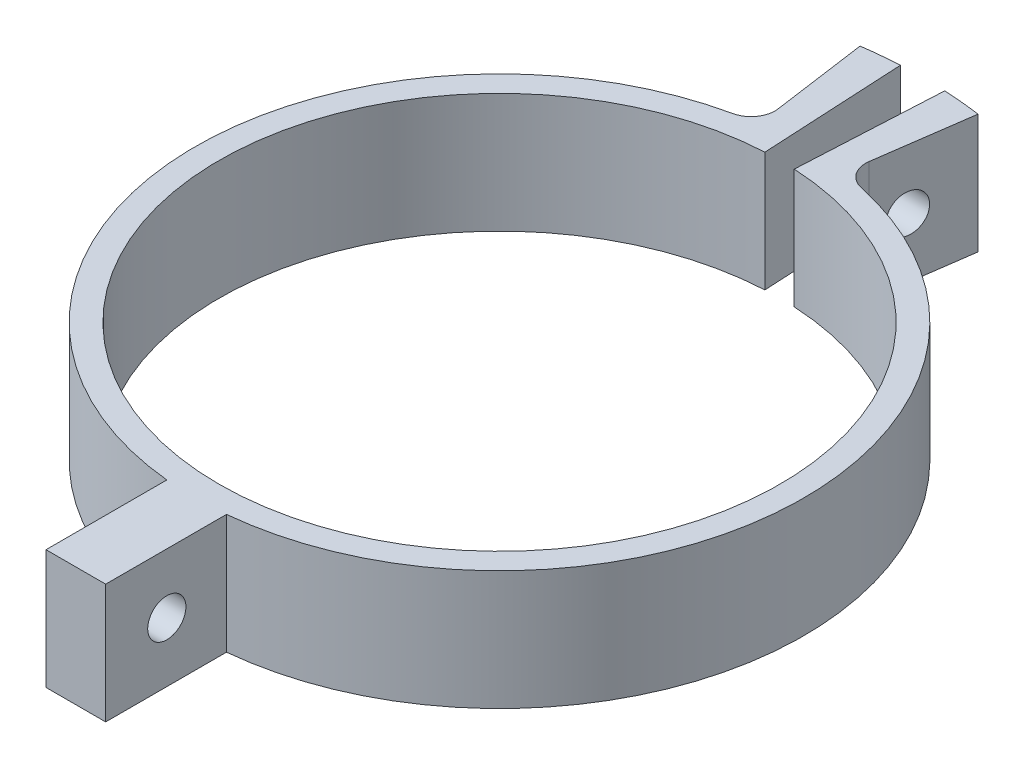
ISO-10303-21;
HEADER;
FILE_DESCRIPTION(('STEP AP214'),'2;1');
FILE_NAME('part.step','',(''),(''),'','','');
FILE_SCHEMA(('AUTOMOTIVE_DESIGN { 1 0 10303 214 1 1 1 1 }'));
ENDSEC;
DATA;
#1=APPLICATION_CONTEXT('core data for automotive mechanical design processes');
#2=APPLICATION_PROTOCOL_DEFINITION('international standard','automotive_design',2000,#1);
#3=PRODUCT_CONTEXT('',#1,'mechanical');
#4=PRODUCT('Part','Part','',(#3));
#5=PRODUCT_RELATED_PRODUCT_CATEGORY('part','',(#4));
#6=PRODUCT_DEFINITION_FORMATION('','',#4);
#7=PRODUCT_DEFINITION_CONTEXT('part definition',#1,'design');
#8=PRODUCT_DEFINITION('design','',#6,#7);
#9=PRODUCT_DEFINITION_SHAPE('','',#8);
#10=(LENGTH_UNIT() NAMED_UNIT(*) SI_UNIT(.MILLI.,.METRE.));
#11=(NAMED_UNIT(*) PLANE_ANGLE_UNIT() SI_UNIT($,.RADIAN.));
#12=(NAMED_UNIT(*) SI_UNIT($,.STERADIAN.) SOLID_ANGLE_UNIT());
#13=UNCERTAINTY_MEASURE_WITH_UNIT(LENGTH_MEASURE(1.E-05),#10,'distance_accuracy_value','');
#14=(GEOMETRIC_REPRESENTATION_CONTEXT(3) GLOBAL_UNCERTAINTY_ASSIGNED_CONTEXT((#13)) GLOBAL_UNIT_ASSIGNED_CONTEXT((#10,
#11,#12)) REPRESENTATION_CONTEXT('',''));
#15=CARTESIAN_POINT('',(0.,0.,0.));
#16=DIRECTION('',(0.,0.,1.));
#17=DIRECTION('',(1.,0.,0.));
#18=AXIS2_PLACEMENT_3D('',#15,#16,#17);
#19=CARTESIAN_POINT('',(0.,12.7,0.));
#20=DIRECTION('',(0.,-1.,0.));
#21=DIRECTION('',(0.,0.,-1.));
#22=AXIS2_PLACEMENT_3D('',#19,#20,#21);
#23=CYLINDRICAL_SURFACE('',#22,32.385);
#24=CARTESIAN_POINT('',(0.,12.7,0.));
#25=DIRECTION('',(0.,1.,0.));
#26=DIRECTION('',(0.,0.,1.));
#27=AXIS2_PLACEMENT_3D('',#24,#25,#26);
#28=CIRCLE('',#27,32.385);
#29=CARTESIAN_POINT('',(-6.82753678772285,12.7,-31.6571155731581));
#30=VERTEX_POINT('',#29);
#31=CARTESIAN_POINT('',(-3.175,12.7,32.2289869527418));
#32=VERTEX_POINT('',#31);
#33=EDGE_CURVE('E226',#30,#32,#28,.T.);
#34=ORIENTED_EDGE('',*,*,#33,.F.);
#35=DIRECTION('',(0.,-1.,0.));
#36=VECTOR('',#35,1.);
#37=CARTESIAN_POINT('',(-6.82753678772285,12.7,-31.6571155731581));
#38=LINE('',#37,#36);
#39=CARTESIAN_POINT('',(-6.82753678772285,0.,-31.6571155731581));
#40=VERTEX_POINT('',#39);
#41=EDGE_CURVE('E246',#30,#40,#38,.T.);
#42=ORIENTED_EDGE('',*,*,#41,.T.);
#43=CARTESIAN_POINT('',(0.,0.,0.));
#44=DIRECTION('',(0.,1.,0.));
#45=DIRECTION('',(0.,0.,1.));
#46=AXIS2_PLACEMENT_3D('',#43,#44,#45);
#47=CIRCLE('',#46,32.385);
#48=CARTESIAN_POINT('',(-3.175,0.,32.2289869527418));
#49=VERTEX_POINT('',#48);
#50=EDGE_CURVE('E229',#40,#49,#47,.T.);
#51=ORIENTED_EDGE('',*,*,#50,.T.);
#52=DIRECTION('',(0.,-1.,0.));
#53=VECTOR('',#52,1.);
#54=CARTESIAN_POINT('',(-3.175,12.7,32.2289869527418));
#55=LINE('',#54,#53);
#56=EDGE_CURVE('E234',#32,#49,#55,.T.);
#57=ORIENTED_EDGE('',*,*,#56,.F.);
#58=EDGE_LOOP('',(#34,#42,#51,#57));
#59=FACE_BOUND('',#58,.T.);
#60=ADVANCED_FACE('F32',(#59),#23,.T.);
#61=CARTESIAN_POINT('',(0.,12.7,0.));
#62=DIRECTION('',(0.,1.,0.));
#63=DIRECTION('',(0.,0.,1.));
#64=AXIS2_PLACEMENT_3D('',#61,#62,#63);
#65=CYLINDRICAL_SURFACE('',#64,45.085);
#66=DIRECTION('',(0.,1.,0.));
#67=VECTOR('',#66,1.);
#68=CARTESIAN_POINT('',(2.35956658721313,0.,-45.02321257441));
#69=LINE('',#68,#67);
#70=CARTESIAN_POINT('',(2.35956658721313,0.,-45.02321257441));
#71=VERTEX_POINT('',#70);
#72=CARTESIAN_POINT('',(2.35956658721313,12.7,-45.02321257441));
#73=VERTEX_POINT('',#72);
#74=EDGE_CURVE('E182',#71,#73,#69,.T.);
#75=ORIENTED_EDGE('',*,*,#74,.T.);
#76=CARTESIAN_POINT('',(0.,12.7,0.));
#77=DIRECTION('',(0.,1.,0.));
#78=DIRECTION('',(0.,0.,1.));
#79=AXIS2_PLACEMENT_3D('',#76,#77,#78);
#80=CIRCLE('',#79,45.085);
#81=CARTESIAN_POINT('',(6.27461925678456,12.7,-44.6462358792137));
#82=VERTEX_POINT('',#81);
#83=EDGE_CURVE('E214',#82,#73,#80,.T.);
#84=ORIENTED_EDGE('',*,*,#83,.F.);
#85=DIRECTION('',(0.,1.,0.));
#86=VECTOR('',#85,1.);
#87=CARTESIAN_POINT('',(6.27461925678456,0.,-44.6462358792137));
#88=LINE('',#87,#86);
#89=CARTESIAN_POINT('',(6.27461925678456,0.,-44.6462358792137));
#90=VERTEX_POINT('',#89);
#91=EDGE_CURVE('E207',#90,#82,#88,.T.);
#92=ORIENTED_EDGE('',*,*,#91,.F.);
#93=CARTESIAN_POINT('',(0.,0.,0.));
#94=DIRECTION('',(0.,1.,0.));
#95=DIRECTION('',(0.,0.,1.));
#96=AXIS2_PLACEMENT_3D('',#93,#94,#95);
#97=CIRCLE('',#96,45.085);
#98=EDGE_CURVE('E218',#90,#71,#97,.T.);
#99=ORIENTED_EDGE('',*,*,#98,.T.);
#100=EDGE_LOOP('',(#75,#84,#92,#99));
#101=FACE_BOUND('',#100,.T.);
#102=ADVANCED_FACE('F275',(#101),#65,.T.);
#103=CARTESIAN_POINT('',(0.,12.7,0.));
#104=DIRECTION('',(0.,1.,0.));
#105=DIRECTION('',(0.,0.,1.));
#106=AXIS2_PLACEMENT_3D('',#103,#104,#105);
#107=PLANE('',#106);
#108=DIRECTION('',(-0.052335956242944,0.,0.998629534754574));
#109=VECTOR('',#108,1.);
#110=CARTESIAN_POINT('',(0.,12.7,0.));
#111=LINE('',#110,#109);
#112=CARTESIAN_POINT('',(1.56196661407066,12.7,-29.8040984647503));
#113=VERTEX_POINT('',#112);
#114=EDGE_CURVE('E185',#73,#113,#111,.T.);
#115=ORIENTED_EDGE('',*,*,#114,.T.);
#116=CARTESIAN_POINT('',(0.,12.7,0.));
#117=DIRECTION('',(0.,1.,0.));
#118=DIRECTION('',(0.,0.,1.));
#119=AXIS2_PLACEMENT_3D('',#116,#117,#118);
#120=CIRCLE('',#119,29.845);
#121=CARTESIAN_POINT('',(-1.56196661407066,12.7,-29.8040984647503));
#122=VERTEX_POINT('',#121);
#123=EDGE_CURVE('E222',#122,#113,#120,.T.);
#124=ORIENTED_EDGE('',*,*,#123,.F.);
#125=DIRECTION('',(0.052335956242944,0.,0.998629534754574));
#126=VECTOR('',#125,1.);
#127=CARTESIAN_POINT('',(0.,12.7,0.));
#128=LINE('',#127,#126);
#129=CARTESIAN_POINT('',(-2.35956658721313,12.7,-45.02321257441));
#130=VERTEX_POINT('',#129);
#131=EDGE_CURVE('E191',#130,#122,#128,.T.);
#132=ORIENTED_EDGE('',*,*,#131,.F.);
#133=CARTESIAN_POINT('',(-6.27461925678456,12.7,-44.6462358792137));
#134=VERTEX_POINT('',#133);
#135=EDGE_CURVE('E213',#130,#134,#80,.T.);
#136=ORIENTED_EDGE('',*,*,#135,.T.);
#137=DIRECTION('',(0.139173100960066,0.,0.99026806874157));
#138=VECTOR('',#137,1.);
#139=CARTESIAN_POINT('',(-4.50712087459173,12.7,-32.0698314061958));
#140=LINE('',#139,#138);
#141=CARTESIAN_POINT('',(-4.84774897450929,12.7,-34.4935262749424));
#142=VERTEX_POINT('',#141);
#143=EDGE_CURVE('E203',#134,#142,#140,.T.);
#144=ORIENTED_EDGE('',*,*,#143,.T.);
#145=CARTESIAN_POINT('',(-7.36302986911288,12.7,-34.1400265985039));
#146=DIRECTION('',(0.,1.,0.));
#147=DIRECTION('',(0.,0.,1.));
#148=AXIS2_PLACEMENT_3D('',#145,#146,#147);
#149=CIRCLE('',#148,2.54);
#150=EDGE_CURVE('E11',#142,#30,#149,.F.);
#151=ORIENTED_EDGE('',*,*,#150,.T.);
#152=ORIENTED_EDGE('',*,*,#33,.T.);
#153=DIRECTION('',(0.,0.,1.));
#154=VECTOR('',#153,1.);
#155=CARTESIAN_POINT('',(-3.175,12.7,29.845));
#156=LINE('',#155,#154);
#157=CARTESIAN_POINT('',(-3.175,12.7,45.085));
#158=VERTEX_POINT('',#157);
#159=EDGE_CURVE('E150',#32,#158,#156,.T.);
#160=ORIENTED_EDGE('',*,*,#159,.T.);
#161=DIRECTION('',(1.,0.,0.));
#162=VECTOR('',#161,1.);
#163=CARTESIAN_POINT('',(-3.175,12.7,45.085));
#164=LINE('',#163,#162);
#165=CARTESIAN_POINT('',(3.175,12.7,45.085));
#166=VERTEX_POINT('',#165);
#167=EDGE_CURVE('E146',#158,#166,#164,.T.);
#168=ORIENTED_EDGE('',*,*,#167,.T.);
#169=DIRECTION('',(0.,0.,1.));
#170=VECTOR('',#169,1.);
#171=CARTESIAN_POINT('',(3.175,12.7,29.845));
#172=LINE('',#171,#170);
#173=CARTESIAN_POINT('',(3.175,12.7,32.2289869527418));
#174=VERTEX_POINT('',#173);
#175=EDGE_CURVE('E132',#174,#166,#172,.T.);
#176=ORIENTED_EDGE('',*,*,#175,.F.);
#177=CARTESIAN_POINT('',(6.82753678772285,12.7,-31.6571155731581));
#178=VERTEX_POINT('',#177);
#179=EDGE_CURVE('E228',#174,#178,#28,.T.);
#180=ORIENTED_EDGE('',*,*,#179,.T.);
#181=CARTESIAN_POINT('',(7.36302986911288,12.7,-34.1400265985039));
#182=DIRECTION('',(0.,1.,0.));
#183=DIRECTION('',(0.,0.,1.));
#184=AXIS2_PLACEMENT_3D('',#181,#182,#183);
#185=CIRCLE('',#184,2.54);
#186=CARTESIAN_POINT('',(4.84774897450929,12.7,-34.4935262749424));
#187=VERTEX_POINT('',#186);
#188=EDGE_CURVE('E244',#178,#187,#185,.F.);
#189=ORIENTED_EDGE('',*,*,#188,.T.);
#190=DIRECTION('',(-0.139173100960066,0.,0.99026806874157));
#191=VECTOR('',#190,1.);
#192=CARTESIAN_POINT('',(4.50712087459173,12.7,-32.0698314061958));
#193=LINE('',#192,#191);
#194=EDGE_CURVE('E210',#82,#187,#193,.T.);
#195=ORIENTED_EDGE('',*,*,#194,.F.);
#196=ORIENTED_EDGE('',*,*,#83,.T.);
#197=EDGE_LOOP('',(#115,#124,#132,#136,#144,#151,#152,#160,#168,#176,#180,#189,#195,#196));
#198=FACE_BOUND('',#197,.T.);
#199=ADVANCED_FACE('F148',(#198),#107,.T.);
#200=CARTESIAN_POINT('',(0.,0.,0.));
#201=DIRECTION('',(0.,1.,0.));
#202=DIRECTION('',(0.,0.,1.));
#203=AXIS2_PLACEMENT_3D('',#200,#201,#202);
#204=PLANE('',#203);
#205=CARTESIAN_POINT('',(0.,0.,0.));
#206=DIRECTION('',(0.,1.,0.));
#207=DIRECTION('',(0.,0.,1.));
#208=AXIS2_PLACEMENT_3D('',#205,#206,#207);
#209=CIRCLE('',#208,29.845);
#210=CARTESIAN_POINT('',(-1.56196661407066,0.,-29.8040984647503));
#211=VERTEX_POINT('',#210);
#212=CARTESIAN_POINT('',(1.56196661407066,0.,-29.8040984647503));
#213=VERTEX_POINT('',#212);
#214=EDGE_CURVE('E221',#211,#213,#209,.T.);
#215=ORIENTED_EDGE('',*,*,#214,.T.);
#216=DIRECTION('',(0.052335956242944,0.,-0.998629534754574));
#217=VECTOR('',#216,1.);
#218=CARTESIAN_POINT('',(0.,0.,0.));
#219=LINE('',#218,#217);
#220=EDGE_CURVE('E179',#213,#71,#219,.T.);
#221=ORIENTED_EDGE('',*,*,#220,.T.);
#222=ORIENTED_EDGE('',*,*,#98,.F.);
#223=DIRECTION('',(0.139173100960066,0.,-0.99026806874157));
#224=VECTOR('',#223,1.);
#225=CARTESIAN_POINT('',(4.50712087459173,0.,-32.0698314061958));
#226=LINE('',#225,#224);
#227=CARTESIAN_POINT('',(4.84774897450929,0.,-34.4935262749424));
#228=VERTEX_POINT('',#227);
#229=EDGE_CURVE('E205',#228,#90,#226,.T.);
#230=ORIENTED_EDGE('',*,*,#229,.F.);
#231=CARTESIAN_POINT('',(7.36302986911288,0.,-34.1400265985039));
#232=DIRECTION('',(0.,1.,0.));
#233=DIRECTION('',(0.,0.,1.));
#234=AXIS2_PLACEMENT_3D('',#231,#232,#233);
#235=CIRCLE('',#234,2.54);
#236=CARTESIAN_POINT('',(6.82753678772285,0.,-31.6571155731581));
#237=VERTEX_POINT('',#236);
#238=EDGE_CURVE('E242',#228,#237,#235,.T.);
#239=ORIENTED_EDGE('',*,*,#238,.T.);
#240=CARTESIAN_POINT('',(3.175,0.,32.2289869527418));
#241=VERTEX_POINT('',#240);
#242=EDGE_CURVE('E224',#241,#237,#47,.T.);
#243=ORIENTED_EDGE('',*,*,#242,.F.);
#244=DIRECTION('',(0.,0.,-1.));
#245=VECTOR('',#244,1.);
#246=CARTESIAN_POINT('',(3.175,0.,29.845));
#247=LINE('',#246,#245);
#248=CARTESIAN_POINT('',(3.175,0.,45.085));
#249=VERTEX_POINT('',#248);
#250=EDGE_CURVE('E158',#249,#241,#247,.T.);
#251=ORIENTED_EDGE('',*,*,#250,.F.);
#252=DIRECTION('',(1.,0.,0.));
#253=VECTOR('',#252,1.);
#254=CARTESIAN_POINT('',(-3.175,0.,45.085));
#255=LINE('',#254,#253);
#256=CARTESIAN_POINT('',(-3.175,0.,45.085));
#257=VERTEX_POINT('',#256);
#258=EDGE_CURVE('E154',#257,#249,#255,.T.);
#259=ORIENTED_EDGE('',*,*,#258,.F.);
#260=DIRECTION('',(0.,0.,-1.));
#261=VECTOR('',#260,1.);
#262=CARTESIAN_POINT('',(-3.175,0.,29.845));
#263=LINE('',#262,#261);
#264=EDGE_CURVE('E155',#257,#49,#263,.T.);
#265=ORIENTED_EDGE('',*,*,#264,.T.);
#266=ORIENTED_EDGE('',*,*,#50,.F.);
#267=CARTESIAN_POINT('',(-7.36302986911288,0.,-34.1400265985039));
#268=DIRECTION('',(0.,1.,0.));
#269=DIRECTION('',(0.,0.,1.));
#270=AXIS2_PLACEMENT_3D('',#267,#268,#269);
#271=CIRCLE('',#270,2.54);
#272=CARTESIAN_POINT('',(-4.84774897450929,0.,-34.4935262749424));
#273=VERTEX_POINT('',#272);
#274=EDGE_CURVE('E40',#40,#273,#271,.T.);
#275=ORIENTED_EDGE('',*,*,#274,.T.);
#276=DIRECTION('',(-0.139173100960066,0.,-0.99026806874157));
#277=VECTOR('',#276,1.);
#278=CARTESIAN_POINT('',(-4.50712087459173,0.,-32.0698314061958));
#279=LINE('',#278,#277);
#280=CARTESIAN_POINT('',(-6.27461925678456,0.,-44.6462358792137));
#281=VERTEX_POINT('',#280);
#282=EDGE_CURVE('E198',#273,#281,#279,.T.);
#283=ORIENTED_EDGE('',*,*,#282,.T.);
#284=CARTESIAN_POINT('',(-2.35956658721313,0.,-45.02321257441));
#285=VERTEX_POINT('',#284);
#286=EDGE_CURVE('E217',#285,#281,#97,.T.);
#287=ORIENTED_EDGE('',*,*,#286,.F.);
#288=DIRECTION('',(-0.052335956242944,0.,-0.998629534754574));
#289=VECTOR('',#288,1.);
#290=CARTESIAN_POINT('',(0.,0.,0.));
#291=LINE('',#290,#289);
#292=EDGE_CURVE('E187',#211,#285,#291,.T.);
#293=ORIENTED_EDGE('',*,*,#292,.F.);
#294=EDGE_LOOP('',(#215,#221,#222,#230,#239,#243,#251,#259,#265,#266,#275,#283,#287,#293));
#295=FACE_BOUND('',#294,.T.);
#296=ADVANCED_FACE('F255',(#295),#204,.F.);
#297=ORIENTED_EDGE('',*,*,#242,.T.);
#298=DIRECTION('',(0.,-1.,0.));
#299=VECTOR('',#298,1.);
#300=CARTESIAN_POINT('',(6.82753678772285,12.7,-31.6571155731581));
#301=LINE('',#300,#299);
#302=EDGE_CURVE('E240',#237,#178,#301,.F.);
#303=ORIENTED_EDGE('',*,*,#302,.T.);
#304=ORIENTED_EDGE('',*,*,#179,.F.);
#305=DIRECTION('',(0.,-1.,0.));
#306=VECTOR('',#305,1.);
#307=CARTESIAN_POINT('',(3.175,12.7,32.2289869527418));
#308=LINE('',#307,#306);
#309=EDGE_CURVE('E139',#174,#241,#308,.T.);
#310=ORIENTED_EDGE('',*,*,#309,.T.);
#311=EDGE_LOOP('',(#297,#303,#304,#310));
#312=FACE_BOUND('',#311,.T.);
#313=ADVANCED_FACE('F277',(#312),#23,.T.);
#314=CARTESIAN_POINT('',(0.,12.7,0.));
#315=DIRECTION('',(0.,-1.,0.));
#316=DIRECTION('',(0.,0.,-1.));
#317=AXIS2_PLACEMENT_3D('',#314,#315,#316);
#318=CYLINDRICAL_SURFACE('',#317,29.845);
#319=DIRECTION('',(0.,-1.,0.));
#320=VECTOR('',#319,1.);
#321=CARTESIAN_POINT('',(1.56196661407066,12.7,-29.8040984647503));
#322=LINE('',#321,#320);
#323=EDGE_CURVE('E193',#113,#213,#322,.T.);
#324=ORIENTED_EDGE('',*,*,#323,.T.);
#325=ORIENTED_EDGE('',*,*,#214,.F.);
#326=DIRECTION('',(0.,-1.,0.));
#327=VECTOR('',#326,1.);
#328=CARTESIAN_POINT('',(-1.56196661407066,12.7,-29.8040984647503));
#329=LINE('',#328,#327);
#330=EDGE_CURVE('E196',#122,#211,#329,.T.);
#331=ORIENTED_EDGE('',*,*,#330,.F.);
#332=ORIENTED_EDGE('',*,*,#123,.T.);
#333=EDGE_LOOP('',(#324,#325,#331,#332));
#334=FACE_BOUND('',#333,.T.);
#335=ADVANCED_FACE('F286',(#334),#318,.F.);
#336=ORIENTED_EDGE('',*,*,#135,.F.);
#337=DIRECTION('',(0.,1.,0.));
#338=VECTOR('',#337,1.);
#339=CARTESIAN_POINT('',(-2.35956658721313,0.,-45.02321257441));
#340=LINE('',#339,#338);
#341=EDGE_CURVE('E189',#285,#130,#340,.T.);
#342=ORIENTED_EDGE('',*,*,#341,.F.);
#343=ORIENTED_EDGE('',*,*,#286,.T.);
#344=DIRECTION('',(0.,1.,0.));
#345=VECTOR('',#344,1.);
#346=CARTESIAN_POINT('',(-6.27461925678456,0.,-44.6462358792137));
#347=LINE('',#346,#345);
#348=EDGE_CURVE('E200',#281,#134,#347,.T.);
#349=ORIENTED_EDGE('',*,*,#348,.T.);
#350=EDGE_LOOP('',(#336,#342,#343,#349));
#351=FACE_BOUND('',#350,.T.);
#352=ADVANCED_FACE('F283',(#351),#65,.T.);
#353=CARTESIAN_POINT('',(0.,0.,0.));
#354=DIRECTION('',(0.99026806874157,0.,0.139173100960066));
#355=DIRECTION('',(0.139173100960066,0.,-0.99026806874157));
#356=AXIS2_PLACEMENT_3D('',#353,#354,#355);
#357=PLANE('',#356);
#358=CARTESIAN_POINT('',(5.35460580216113,6.35,-38.1));
#359=DIRECTION('',(0.99026806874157,0.,0.139173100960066));
#360=DIRECTION('',(-0.139173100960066,0.,0.99026806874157));
#361=AXIS2_PLACEMENT_3D('',#358,#359,#360);
#362=ELLIPSE('',#361,2.05196962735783,2.032);
#363=CARTESIAN_POINT('',(5.06902682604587,6.35,-36.068));
#364=VERTEX_POINT('',#363);
#365=EDGE_CURVE('E176',#364,#364,#362,.F.);
#366=ORIENTED_EDGE('',*,*,#365,.T.);
#367=EDGE_LOOP('',(#366));
#368=FACE_BOUND('',#367,.T.);
#369=ORIENTED_EDGE('',*,*,#194,.T.);
#370=DIRECTION('',(0.,-1.,0.));
#371=VECTOR('',#370,1.);
#372=CARTESIAN_POINT('',(4.84774897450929,0.,-34.4935262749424));
#373=LINE('',#372,#371);
#374=EDGE_CURVE('E237',#187,#228,#373,.T.);
#375=ORIENTED_EDGE('',*,*,#374,.T.);
#376=ORIENTED_EDGE('',*,*,#229,.T.);
#377=ORIENTED_EDGE('',*,*,#91,.T.);
#378=EDGE_LOOP('',(#369,#375,#376,#377));
#379=FACE_BOUND('',#378,.T.);
#380=ADVANCED_FACE('F303',(#368,#379),#357,.T.);
#381=CARTESIAN_POINT('',(0.,0.,0.));
#382=DIRECTION('',(0.99026806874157,0.,-0.139173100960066));
#383=DIRECTION('',(-0.139173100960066,0.,-0.99026806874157));
#384=AXIS2_PLACEMENT_3D('',#381,#382,#383);
#385=PLANE('',#384);
#386=CARTESIAN_POINT('',(-5.35460580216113,6.35,-38.1));
#387=DIRECTION('',(0.99026806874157,0.,-0.139173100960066));
#388=DIRECTION('',(-0.139173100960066,0.,-0.99026806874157));
#389=AXIS2_PLACEMENT_3D('',#386,#387,#388);
#390=ELLIPSE('',#389,2.05196962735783,2.032);
#391=CARTESIAN_POINT('',(-5.64018477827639,6.35,-40.132));
#392=VERTEX_POINT('',#391);
#393=EDGE_CURVE('E173',#392,#392,#390,.F.);
#394=ORIENTED_EDGE('',*,*,#393,.F.);
#395=EDGE_LOOP('',(#394));
#396=FACE_BOUND('',#395,.T.);
#397=ORIENTED_EDGE('',*,*,#282,.F.);
#398=DIRECTION('',(0.,1.,0.));
#399=VECTOR('',#398,1.);
#400=CARTESIAN_POINT('',(-4.84774897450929,12.7,-34.4935262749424));
#401=LINE('',#400,#399);
#402=EDGE_CURVE('E47',#273,#142,#401,.T.);
#403=ORIENTED_EDGE('',*,*,#402,.T.);
#404=ORIENTED_EDGE('',*,*,#143,.F.);
#405=ORIENTED_EDGE('',*,*,#348,.F.);
#406=EDGE_LOOP('',(#397,#403,#404,#405));
#407=FACE_BOUND('',#406,.T.);
#408=ADVANCED_FACE('F324',(#396,#407),#385,.F.);
#409=CARTESIAN_POINT('',(0.,0.,0.));
#410=DIRECTION('',(-0.998629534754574,0.,-0.052335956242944));
#411=DIRECTION('',(-0.052335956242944,0.,0.998629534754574));
#412=AXIS2_PLACEMENT_3D('',#409,#410,#411);
#413=PLANE('',#412);
#414=CARTESIAN_POINT('',(1.99673639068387,6.35,-38.1));
#415=DIRECTION('',(-0.998629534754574,0.,-0.052335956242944));
#416=DIRECTION('',(-0.052335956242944,0.,0.998629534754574));
#417=AXIS2_PLACEMENT_3D('',#414,#415,#416);
#418=ELLIPSE('',#417,2.03478860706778,2.032);
#419=CARTESIAN_POINT('',(1.89024378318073,6.35,-36.068));
#420=VERTEX_POINT('',#419);
#421=EDGE_CURVE('E170',#420,#420,#418,.F.);
#422=ORIENTED_EDGE('',*,*,#421,.T.);
#423=EDGE_LOOP('',(#422));
#424=FACE_BOUND('',#423,.T.);
#425=ORIENTED_EDGE('',*,*,#114,.F.);
#426=ORIENTED_EDGE('',*,*,#74,.F.);
#427=ORIENTED_EDGE('',*,*,#220,.F.);
#428=ORIENTED_EDGE('',*,*,#323,.F.);
#429=EDGE_LOOP('',(#425,#426,#427,#428));
#430=FACE_BOUND('',#429,.T.);
#431=ADVANCED_FACE('F311',(#424,#430),#413,.T.);
#432=CARTESIAN_POINT('',(0.,0.,0.));
#433=DIRECTION('',(-0.998629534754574,0.,0.052335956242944));
#434=DIRECTION('',(0.052335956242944,0.,0.998629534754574));
#435=AXIS2_PLACEMENT_3D('',#432,#433,#434);
#436=PLANE('',#435);
#437=CARTESIAN_POINT('',(-1.99673639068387,6.35,-38.1));
#438=DIRECTION('',(-0.998629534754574,0.,0.052335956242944));
#439=DIRECTION('',(-0.052335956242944,0.,-0.998629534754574));
#440=AXIS2_PLACEMENT_3D('',#437,#438,#439);
#441=ELLIPSE('',#440,2.03478860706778,2.032);
#442=CARTESIAN_POINT('',(-2.10322899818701,6.35,-40.132));
#443=VERTEX_POINT('',#442);
#444=EDGE_CURVE('E168',#443,#443,#441,.F.);
#445=ORIENTED_EDGE('',*,*,#444,.F.);
#446=EDGE_LOOP('',(#445));
#447=FACE_BOUND('',#446,.T.);
#448=ORIENTED_EDGE('',*,*,#330,.T.);
#449=ORIENTED_EDGE('',*,*,#292,.T.);
#450=ORIENTED_EDGE('',*,*,#341,.T.);
#451=ORIENTED_EDGE('',*,*,#131,.T.);
#452=EDGE_LOOP('',(#448,#449,#450,#451));
#453=FACE_BOUND('',#452,.T.);
#454=ADVANCED_FACE('F317',(#447,#453),#436,.F.);
#455=CARTESIAN_POINT('',(12.7,6.35,-38.1));
#456=DIRECTION('',(-1.,0.,0.));
#457=DIRECTION('',(0.,0.,1.));
#458=AXIS2_PLACEMENT_3D('',#455,#456,#457);
#459=CYLINDRICAL_SURFACE('',#458,2.032);
#460=ORIENTED_EDGE('',*,*,#444,.T.);
#461=EDGE_LOOP('',(#460));
#462=FACE_BOUND('',#461,.T.);
#463=ORIENTED_EDGE('',*,*,#393,.T.);
#464=EDGE_LOOP('',(#463));
#465=FACE_BOUND('',#464,.T.);
#466=ADVANCED_FACE('F269',(#462,#465),#459,.F.);
#467=ORIENTED_EDGE('',*,*,#365,.F.);
#468=EDGE_LOOP('',(#467));
#469=FACE_BOUND('',#468,.T.);
#470=ORIENTED_EDGE('',*,*,#421,.F.);
#471=EDGE_LOOP('',(#470));
#472=FACE_BOUND('',#471,.T.);
#473=ADVANCED_FACE('F260',(#469,#472),#459,.F.);
#474=CARTESIAN_POINT('',(-3.175,0.,0.));
#475=DIRECTION('',(1.,0.,0.));
#476=DIRECTION('',(0.,0.,-1.));
#477=AXIS2_PLACEMENT_3D('',#474,#475,#476);
#478=PLANE('',#477);
#479=CARTESIAN_POINT('',(-3.175,6.35047915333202,38.5789869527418));
#480=DIRECTION('',(1.,0.,0.));
#481=DIRECTION('',(0.,0.,-1.));
#482=AXIS2_PLACEMENT_3D('',#479,#480,#481);
#483=CIRCLE('',#482,2.032);
#484=CARTESIAN_POINT('',(-3.175,6.35047915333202,36.5469869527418));
#485=VERTEX_POINT('',#484);
#486=EDGE_CURVE('E143',#485,#485,#483,.T.);
#487=ORIENTED_EDGE('',*,*,#486,.T.);
#488=EDGE_LOOP('',(#487));
#489=FACE_BOUND('',#488,.T.);
#490=ORIENTED_EDGE('',*,*,#159,.F.);
#491=ORIENTED_EDGE('',*,*,#56,.T.);
#492=ORIENTED_EDGE('',*,*,#264,.F.);
#493=DIRECTION('',(0.,-1.,0.));
#494=VECTOR('',#493,1.);
#495=CARTESIAN_POINT('',(-3.175,12.7,45.085));
#496=LINE('',#495,#494);
#497=EDGE_CURVE('E164',#158,#257,#496,.T.);
#498=ORIENTED_EDGE('',*,*,#497,.F.);
#499=EDGE_LOOP('',(#490,#491,#492,#498));
#500=FACE_BOUND('',#499,.T.);
#501=ADVANCED_FACE('F258',(#489,#500),#478,.F.);
#502=CARTESIAN_POINT('',(3.175,0.,0.));
#503=DIRECTION('',(1.,0.,0.));
#504=DIRECTION('',(0.,0.,-1.));
#505=AXIS2_PLACEMENT_3D('',#502,#503,#504);
#506=PLANE('',#505);
#507=CARTESIAN_POINT('',(3.175,6.35047915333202,38.5789869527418));
#508=DIRECTION('',(1.,0.,0.));
#509=DIRECTION('',(0.,0.,-1.));
#510=AXIS2_PLACEMENT_3D('',#507,#508,#509);
#511=CIRCLE('',#510,2.032);
#512=CARTESIAN_POINT('',(3.175,6.35047915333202,36.5469869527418));
#513=VERTEX_POINT('',#512);
#514=EDGE_CURVE('E341',#513,#513,#511,.T.);
#515=ORIENTED_EDGE('',*,*,#514,.F.);
#516=EDGE_LOOP('',(#515));
#517=FACE_BOUND('',#516,.T.);
#518=ORIENTED_EDGE('',*,*,#309,.F.);
#519=ORIENTED_EDGE('',*,*,#175,.T.);
#520=DIRECTION('',(0.,-1.,0.));
#521=VECTOR('',#520,1.);
#522=CARTESIAN_POINT('',(3.175,12.7,45.085));
#523=LINE('',#522,#521);
#524=EDGE_CURVE('E136',#166,#249,#523,.T.);
#525=ORIENTED_EDGE('',*,*,#524,.T.);
#526=ORIENTED_EDGE('',*,*,#250,.T.);
#527=EDGE_LOOP('',(#518,#519,#525,#526));
#528=FACE_BOUND('',#527,.T.);
#529=ADVANCED_FACE('F134',(#517,#528),#506,.T.);
#530=CARTESIAN_POINT('',(-3.175,12.7,45.085));
#531=DIRECTION('',(0.,0.,1.));
#532=DIRECTION('',(1.,0.,0.));
#533=AXIS2_PLACEMENT_3D('',#530,#531,#532);
#534=PLANE('',#533);
#535=ORIENTED_EDGE('',*,*,#258,.T.);
#536=ORIENTED_EDGE('',*,*,#524,.F.);
#537=ORIENTED_EDGE('',*,*,#167,.F.);
#538=ORIENTED_EDGE('',*,*,#497,.T.);
#539=EDGE_LOOP('',(#535,#536,#537,#538));
#540=FACE_BOUND('',#539,.T.);
#541=ADVANCED_FACE('F157',(#540),#534,.T.);
#542=CARTESIAN_POINT('',(-32.385,6.35047915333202,38.5789869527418));
#543=DIRECTION('',(1.,0.,0.));
#544=DIRECTION('',(0.,0.,-1.));
#545=AXIS2_PLACEMENT_3D('',#542,#543,#544);
#546=CYLINDRICAL_SURFACE('',#545,2.032);
#547=CARTESIAN_POINT('',(3.175,6.35047915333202,36.5469869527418));
#548=CARTESIAN_POINT('',(3.10885416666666,6.35047915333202,36.5469869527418));
#549=CARTESIAN_POINT('',(3.04270833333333,6.35047915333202,36.5469869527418));
#550=CARTESIAN_POINT('',(2.91041666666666,6.35047915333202,36.5469869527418));
#551=CARTESIAN_POINT('',(2.84427083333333,6.35047915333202,36.5469869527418));
#552=CARTESIAN_POINT('',(2.71197916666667,6.35047915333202,36.5469869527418));
#553=CARTESIAN_POINT('',(2.64583333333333,6.35047915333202,36.5469869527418));
#554=CARTESIAN_POINT('',(2.51354166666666,6.35047915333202,36.5469869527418));
#555=CARTESIAN_POINT('',(2.44739583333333,6.35047915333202,36.5469869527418));
#556=CARTESIAN_POINT('',(2.31510416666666,6.35047915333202,36.5469869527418));
#557=CARTESIAN_POINT('',(2.24895833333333,6.35047915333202,36.5469869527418));
#558=CARTESIAN_POINT('',(2.11666666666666,6.35047915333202,36.5469869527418));
#559=CARTESIAN_POINT('',(2.05052083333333,6.35047915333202,36.5469869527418));
#560=CARTESIAN_POINT('',(1.91822916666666,6.35047915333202,36.5469869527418));
#561=CARTESIAN_POINT('',(1.85208333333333,6.35047915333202,36.5469869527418));
#562=CARTESIAN_POINT('',(1.71979166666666,6.35047915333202,36.5469869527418));
#563=CARTESIAN_POINT('',(1.65364583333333,6.35047915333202,36.5469869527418));
#564=CARTESIAN_POINT('',(1.52135416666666,6.35047915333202,36.5469869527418));
#565=CARTESIAN_POINT('',(1.45520833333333,6.35047915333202,36.5469869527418));
#566=CARTESIAN_POINT('',(1.32291666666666,6.35047915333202,36.5469869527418));
#567=CARTESIAN_POINT('',(1.25677083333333,6.35047915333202,36.5469869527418));
#568=CARTESIAN_POINT('',(1.12447916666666,6.35047915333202,36.5469869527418));
#569=CARTESIAN_POINT('',(1.05833333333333,6.35047915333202,36.5469869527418));
#570=CARTESIAN_POINT('',(0.926041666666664,6.35047915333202,36.5469869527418));
#571=CARTESIAN_POINT('',(0.85989583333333,6.35047915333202,36.5469869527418));
#572=CARTESIAN_POINT('',(0.727604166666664,6.35047915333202,36.5469869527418));
#573=CARTESIAN_POINT('',(0.661458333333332,6.35047915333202,36.5469869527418));
#574=CARTESIAN_POINT('',(0.529166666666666,6.35047915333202,36.5469869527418));
#575=CARTESIAN_POINT('',(0.463020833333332,6.35047915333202,36.5469869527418));
#576=CARTESIAN_POINT('',(0.330729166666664,6.35047915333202,36.5469869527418));
#577=CARTESIAN_POINT('',(0.26458333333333,6.35047915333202,36.5469869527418));
#578=CARTESIAN_POINT('',(0.132291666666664,6.35047915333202,36.5469869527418));
#579=CARTESIAN_POINT('',(0.0661458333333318,6.35047915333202,36.5469869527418));
#580=CARTESIAN_POINT('',(-0.0661458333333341,6.35047915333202,36.5469869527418));
#581=CARTESIAN_POINT('',(-0.132291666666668,6.35047915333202,36.5469869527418));
#582=CARTESIAN_POINT('',(-0.264583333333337,6.35047915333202,36.5469869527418));
#583=CARTESIAN_POINT('',(-0.330729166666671,6.35047915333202,36.5469869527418));
#584=CARTESIAN_POINT('',(-0.463020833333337,6.35047915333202,36.5469869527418));
#585=CARTESIAN_POINT('',(-0.529166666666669,6.35047915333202,36.5469869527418));
#586=CARTESIAN_POINT('',(-0.661458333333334,6.35047915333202,36.5469869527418));
#587=CARTESIAN_POINT('',(-0.727604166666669,6.35047915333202,36.5469869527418));
#588=CARTESIAN_POINT('',(-0.859895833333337,6.35047915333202,36.5469869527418));
#589=CARTESIAN_POINT('',(-0.926041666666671,6.35047915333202,36.5469869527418));
#590=CARTESIAN_POINT('',(-1.05833333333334,6.35047915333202,36.5469869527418));
#591=CARTESIAN_POINT('',(-1.12447916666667,6.35047915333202,36.5469869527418));
#592=CARTESIAN_POINT('',(-1.25677083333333,6.35047915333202,36.5469869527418));
#593=CARTESIAN_POINT('',(-1.32291666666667,6.35047915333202,36.5469869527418));
#594=CARTESIAN_POINT('',(-1.45520833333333,6.35047915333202,36.5469869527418));
#595=CARTESIAN_POINT('',(-1.52135416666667,6.35047915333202,36.5469869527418));
#596=CARTESIAN_POINT('',(-1.65364583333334,6.35047915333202,36.5469869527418));
#597=CARTESIAN_POINT('',(-1.71979166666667,6.35047915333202,36.5469869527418));
#598=CARTESIAN_POINT('',(-1.85208333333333,6.35047915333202,36.5469869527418));
#599=CARTESIAN_POINT('',(-1.91822916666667,6.35047915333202,36.5469869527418));
#600=CARTESIAN_POINT('',(-2.05052083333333,6.35047915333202,36.5469869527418));
#601=CARTESIAN_POINT('',(-2.11666666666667,6.35047915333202,36.5469869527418));
#602=CARTESIAN_POINT('',(-2.24895833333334,6.35047915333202,36.5469869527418));
#603=CARTESIAN_POINT('',(-2.31510416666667,6.35047915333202,36.5469869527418));
#604=CARTESIAN_POINT('',(-2.44739583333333,6.35047915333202,36.5469869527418));
#605=CARTESIAN_POINT('',(-2.51354166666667,6.35047915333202,36.5469869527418));
#606=CARTESIAN_POINT('',(-2.64583333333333,6.35047915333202,36.5469869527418));
#607=CARTESIAN_POINT('',(-2.71197916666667,6.35047915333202,36.5469869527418));
#608=CARTESIAN_POINT('',(-2.84427083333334,6.35047915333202,36.5469869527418));
#609=CARTESIAN_POINT('',(-2.91041666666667,6.35047915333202,36.5469869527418));
#610=CARTESIAN_POINT('',(-3.04270833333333,6.35047915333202,36.5469869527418));
#611=CARTESIAN_POINT('',(-3.10885416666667,6.35047915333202,36.5469869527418));
#612=CARTESIAN_POINT('',(-3.175,6.35047915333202,36.5469869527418));
#613=B_SPLINE_CURVE_WITH_KNOTS('',3,(#547,#548,#549,#550,#551,#552,#553,#554,#555,#556,#557,
#558,#559,#560,#561,#562,#563,#564,#565,#566,#567,#568,#569,#570,#571,#572,#573,#574,#575,#576,
#577,#578,#579,#580,#581,#582,#583,#584,#585,#586,#587,#588,#589,#590,#591,#592,#593,#594,#595,
#596,#597,#598,#599,#600,#601,#602,#603,#604,#605,#606,#607,#608,#609,#610,#611,#612),
.UNSPECIFIED.,.F.,.F.,(4,2,2,2,2,2,2,2,2,2,2,2,2,2,2,2,2,2,2,2,2,2,2,2,2,2,2,2,2,2,2,2,4),(0.,
0.198437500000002,0.396874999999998,0.5953125,0.793750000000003,0.992187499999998,1.190625,
1.3890625,1.5875,1.7859375,1.984375,2.1828125,2.38125,2.5796875,2.778125,2.9765625,3.175,
3.3734375,3.571875,3.7703125,3.96875,4.1671875,4.365625,4.5640625,4.7625,4.9609375,5.159375,
5.3578125,5.55625,5.7546875,5.953125,6.1515625,6.35),.UNSPECIFIED.);
#614=EDGE_CURVE('BSEAM329',#513,#485,#613,.T.);
#615=ORIENTED_EDGE('',*,*,#514,.T.);
#616=ORIENTED_EDGE('',*,*,#486,.F.);
#617=ORIENTED_EDGE('',*,*,#614,.T.);
#618=ORIENTED_EDGE('',*,*,#614,.F.);
#619=EDGE_LOOP('',(#615,#617,#616,#618));
#620=FACE_BOUND('',#619,.T.);
#621=ADVANCED_FACE('F329',(#620),#546,.F.);
#622=CARTESIAN_POINT('',(7.36302986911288,12.7,-34.1400265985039));
#623=DIRECTION('',(0.,-1.,0.));
#624=DIRECTION('',(0.,0.,-1.));
#625=AXIS2_PLACEMENT_3D('',#622,#623,#624);
#626=CYLINDRICAL_SURFACE('',#625,2.54);
#627=ORIENTED_EDGE('',*,*,#188,.F.);
#628=ORIENTED_EDGE('',*,*,#302,.F.);
#629=ORIENTED_EDGE('',*,*,#238,.F.);
#630=ORIENTED_EDGE('',*,*,#374,.F.);
#631=EDGE_LOOP('',(#627,#628,#629,#630));
#632=FACE_BOUND('',#631,.T.);
#633=ADVANCED_FACE('F299',(#632),#626,.F.);
#634=CARTESIAN_POINT('',(-7.36302986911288,12.7,-34.1400265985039));
#635=DIRECTION('',(0.,-1.,0.));
#636=DIRECTION('',(0.,0.,-1.));
#637=AXIS2_PLACEMENT_3D('',#634,#635,#636);
#638=CYLINDRICAL_SURFACE('',#637,2.54);
#639=ORIENTED_EDGE('',*,*,#150,.F.);
#640=ORIENTED_EDGE('',*,*,#402,.F.);
#641=ORIENTED_EDGE('',*,*,#274,.F.);
#642=ORIENTED_EDGE('',*,*,#41,.F.);
#643=EDGE_LOOP('',(#639,#640,#641,#642));
#644=FACE_BOUND('',#643,.T.);
#645=ADVANCED_FACE('F34',(#644),#638,.F.);
#646=CLOSED_SHELL('',(#60,#102,#199,#296,#313,#335,#352,#380,#408,#431,#454,#466,#473,#501,#529,
#541,#621,#633,#645));
#647=MANIFOLD_SOLID_BREP('B2',#646);
#648=ADVANCED_BREP_SHAPE_REPRESENTATION('',(#18,#647),#14);
#649=SHAPE_DEFINITION_REPRESENTATION(#9,#648);
ENDSEC;
END-ISO-10303-21;
